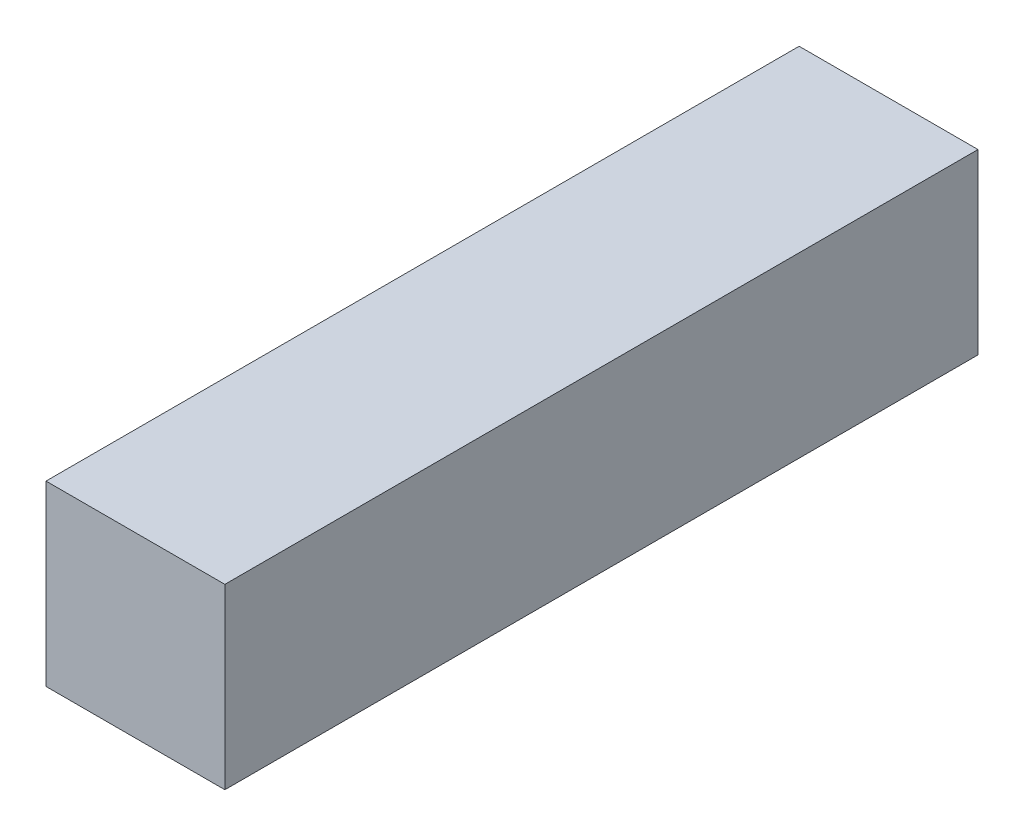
ISO-10303-21;
HEADER;
FILE_DESCRIPTION(('STEP AP214'),'2;1');
FILE_NAME('part.step','',(''),(''),'','','');
FILE_SCHEMA(('AUTOMOTIVE_DESIGN { 1 0 10303 214 1 1 1 1 }'));
ENDSEC;
DATA;
#1=APPLICATION_CONTEXT('core data for automotive mechanical design processes');
#2=APPLICATION_PROTOCOL_DEFINITION('international standard','automotive_design',2000,#1);
#3=PRODUCT_CONTEXT('',#1,'mechanical');
#4=PRODUCT('Part','Part','',(#3));
#5=PRODUCT_RELATED_PRODUCT_CATEGORY('part','',(#4));
#6=PRODUCT_DEFINITION_FORMATION('','',#4);
#7=PRODUCT_DEFINITION_CONTEXT('part definition',#1,'design');
#8=PRODUCT_DEFINITION('design','',#6,#7);
#9=PRODUCT_DEFINITION_SHAPE('','',#8);
#10=(LENGTH_UNIT() NAMED_UNIT(*) SI_UNIT(.MILLI.,.METRE.));
#11=(NAMED_UNIT(*) PLANE_ANGLE_UNIT() SI_UNIT($,.RADIAN.));
#12=(NAMED_UNIT(*) SI_UNIT($,.STERADIAN.) SOLID_ANGLE_UNIT());
#13=UNCERTAINTY_MEASURE_WITH_UNIT(LENGTH_MEASURE(1.E-05),#10,'distance_accuracy_value','');
#14=(GEOMETRIC_REPRESENTATION_CONTEXT(3) GLOBAL_UNCERTAINTY_ASSIGNED_CONTEXT((#13)) GLOBAL_UNIT_ASSIGNED_CONTEXT((#10,
#11,#12)) REPRESENTATION_CONTEXT('',''));
#15=CARTESIAN_POINT('',(0.,0.,0.));
#16=DIRECTION('',(0.,0.,1.));
#17=DIRECTION('',(1.,0.,0.));
#18=AXIS2_PLACEMENT_3D('',#15,#16,#17);
#19=CARTESIAN_POINT('',(0.,0.,20.));
#20=DIRECTION('',(1.,0.,0.));
#21=DIRECTION('',(0.,0.,-1.));
#22=AXIS2_PLACEMENT_3D('',#19,#20,#21);
#23=PLANE('',#22);
#24=DIRECTION('',(0.,-1.,0.));
#25=VECTOR('',#24,1.);
#26=CARTESIAN_POINT('',(0.,0.,0.));
#27=LINE('',#26,#25);
#28=CARTESIAN_POINT('',(0.,4.724,0.));
#29=VERTEX_POINT('',#28);
#30=CARTESIAN_POINT('',(0.,0.,0.));
#31=VERTEX_POINT('',#30);
#32=EDGE_CURVE('E113',#29,#31,#27,.T.);
#33=ORIENTED_EDGE('',*,*,#32,.T.);
#34=DIRECTION('',(0.,0.,-1.));
#35=VECTOR('',#34,1.);
#36=CARTESIAN_POINT('',(0.,0.,20.));
#37=LINE('',#36,#35);
#38=CARTESIAN_POINT('',(0.,0.,20.));
#39=VERTEX_POINT('',#38);
#40=EDGE_CURVE('E11',#39,#31,#37,.T.);
#41=ORIENTED_EDGE('',*,*,#40,.F.);
#42=DIRECTION('',(0.,-1.,0.));
#43=VECTOR('',#42,1.);
#44=CARTESIAN_POINT('',(0.,0.,20.));
#45=LINE('',#44,#43);
#46=CARTESIAN_POINT('',(0.,4.724,20.));
#47=VERTEX_POINT('',#46);
#48=EDGE_CURVE('E97',#47,#39,#45,.T.);
#49=ORIENTED_EDGE('',*,*,#48,.F.);
#50=DIRECTION('',(0.,0.,-1.));
#51=VECTOR('',#50,1.);
#52=CARTESIAN_POINT('',(0.,4.724,20.));
#53=LINE('',#52,#51);
#54=EDGE_CURVE('E109',#47,#29,#53,.T.);
#55=ORIENTED_EDGE('',*,*,#54,.T.);
#56=EDGE_LOOP('',(#33,#41,#49,#55));
#57=FACE_BOUND('',#56,.T.);
#58=ADVANCED_FACE('F45',(#57),#23,.F.);
#59=CARTESIAN_POINT('',(0.,0.,20.));
#60=DIRECTION('',(0.,1.,0.));
#61=DIRECTION('',(0.,0.,1.));
#62=AXIS2_PLACEMENT_3D('',#59,#60,#61);
#63=PLANE('',#62);
#64=DIRECTION('',(1.,0.,0.));
#65=VECTOR('',#64,1.);
#66=CARTESIAN_POINT('',(0.,0.,0.));
#67=LINE('',#66,#65);
#68=CARTESIAN_POINT('',(4.75,0.,0.));
#69=VERTEX_POINT('',#68);
#70=EDGE_CURVE('E102',#31,#69,#67,.T.);
#71=ORIENTED_EDGE('',*,*,#70,.T.);
#72=DIRECTION('',(0.,0.,-1.));
#73=VECTOR('',#72,1.);
#74=CARTESIAN_POINT('',(4.75,0.,20.));
#75=LINE('',#74,#73);
#76=CARTESIAN_POINT('',(4.75,0.,20.));
#77=VERTEX_POINT('',#76);
#78=EDGE_CURVE('E54',#77,#69,#75,.T.);
#79=ORIENTED_EDGE('',*,*,#78,.F.);
#80=DIRECTION('',(1.,0.,0.));
#81=VECTOR('',#80,1.);
#82=CARTESIAN_POINT('',(0.,0.,20.));
#83=LINE('',#82,#81);
#84=EDGE_CURVE('E92',#39,#77,#83,.T.);
#85=ORIENTED_EDGE('',*,*,#84,.F.);
#86=ORIENTED_EDGE('',*,*,#40,.T.);
#87=EDGE_LOOP('',(#71,#79,#85,#86));
#88=FACE_BOUND('',#87,.T.);
#89=ADVANCED_FACE('F101',(#88),#63,.F.);
#90=CARTESIAN_POINT('',(4.75,0.,20.));
#91=DIRECTION('',(-1.,0.,0.));
#92=DIRECTION('',(0.,-1.,0.));
#93=AXIS2_PLACEMENT_3D('',#90,#91,#92);
#94=PLANE('',#93);
#95=DIRECTION('',(0.,1.,0.));
#96=VECTOR('',#95,1.);
#97=CARTESIAN_POINT('',(4.75,0.,0.));
#98=LINE('',#97,#96);
#99=CARTESIAN_POINT('',(4.75,4.724,0.));
#100=VERTEX_POINT('',#99);
#101=EDGE_CURVE('E79',#69,#100,#98,.T.);
#102=ORIENTED_EDGE('',*,*,#101,.T.);
#103=DIRECTION('',(0.,0.,-1.));
#104=VECTOR('',#103,1.);
#105=CARTESIAN_POINT('',(4.75,4.724,20.));
#106=LINE('',#105,#104);
#107=CARTESIAN_POINT('',(4.75,4.724,20.));
#108=VERTEX_POINT('',#107);
#109=EDGE_CURVE('E104',#108,#100,#106,.T.);
#110=ORIENTED_EDGE('',*,*,#109,.F.);
#111=DIRECTION('',(0.,1.,0.));
#112=VECTOR('',#111,1.);
#113=CARTESIAN_POINT('',(4.75,0.,20.));
#114=LINE('',#113,#112);
#115=EDGE_CURVE('E95',#77,#108,#114,.T.);
#116=ORIENTED_EDGE('',*,*,#115,.F.);
#117=ORIENTED_EDGE('',*,*,#78,.T.);
#118=EDGE_LOOP('',(#102,#110,#116,#117));
#119=FACE_BOUND('',#118,.T.);
#120=ADVANCED_FACE('F105',(#119),#94,.F.);
#121=CARTESIAN_POINT('',(0.,4.724,20.));
#122=DIRECTION('',(0.,-1.,0.));
#123=DIRECTION('',(0.,0.,-1.));
#124=AXIS2_PLACEMENT_3D('',#121,#122,#123);
#125=PLANE('',#124);
#126=DIRECTION('',(-1.,0.,0.));
#127=VECTOR('',#126,1.);
#128=CARTESIAN_POINT('',(0.,4.724,0.));
#129=LINE('',#128,#127);
#130=EDGE_CURVE('E85',#100,#29,#129,.T.);
#131=ORIENTED_EDGE('',*,*,#130,.T.);
#132=ORIENTED_EDGE('',*,*,#54,.F.);
#133=DIRECTION('',(-1.,0.,0.));
#134=VECTOR('',#133,1.);
#135=CARTESIAN_POINT('',(0.,4.724,20.));
#136=LINE('',#135,#134);
#137=EDGE_CURVE('E62',#108,#47,#136,.T.);
#138=ORIENTED_EDGE('',*,*,#137,.F.);
#139=ORIENTED_EDGE('',*,*,#109,.T.);
#140=EDGE_LOOP('',(#131,#132,#138,#139));
#141=FACE_BOUND('',#140,.T.);
#142=ADVANCED_FACE('F126',(#141),#125,.F.);
#143=CARTESIAN_POINT('',(0.,0.,20.));
#144=DIRECTION('',(0.,0.,-1.));
#145=DIRECTION('',(-1.,0.,0.));
#146=AXIS2_PLACEMENT_3D('',#143,#144,#145);
#147=PLANE('',#146);
#148=ORIENTED_EDGE('',*,*,#48,.T.);
#149=ORIENTED_EDGE('',*,*,#84,.T.);
#150=ORIENTED_EDGE('',*,*,#115,.T.);
#151=ORIENTED_EDGE('',*,*,#137,.T.);
#152=EDGE_LOOP('',(#148,#149,#150,#151));
#153=FACE_BOUND('',#152,.T.);
#154=ADVANCED_FACE('F93',(#153),#147,.F.);
#155=CARTESIAN_POINT('',(0.,0.,0.));
#156=DIRECTION('',(0.,0.,-1.));
#157=DIRECTION('',(-1.,0.,0.));
#158=AXIS2_PLACEMENT_3D('',#155,#156,#157);
#159=PLANE('',#158);
#160=ORIENTED_EDGE('',*,*,#32,.F.);
#161=ORIENTED_EDGE('',*,*,#130,.F.);
#162=ORIENTED_EDGE('',*,*,#101,.F.);
#163=ORIENTED_EDGE('',*,*,#70,.F.);
#164=EDGE_LOOP('',(#160,#161,#162,#163));
#165=FACE_BOUND('',#164,.T.);
#166=ADVANCED_FACE('F129',(#165),#159,.T.);
#167=CLOSED_SHELL('',(#58,#89,#120,#142,#154,#166));
#168=MANIFOLD_SOLID_BREP('B2',#167);
#169=ADVANCED_BREP_SHAPE_REPRESENTATION('',(#18,#168),#14);
#170=SHAPE_DEFINITION_REPRESENTATION(#9,#169);
ENDSEC;
END-ISO-10303-21;
